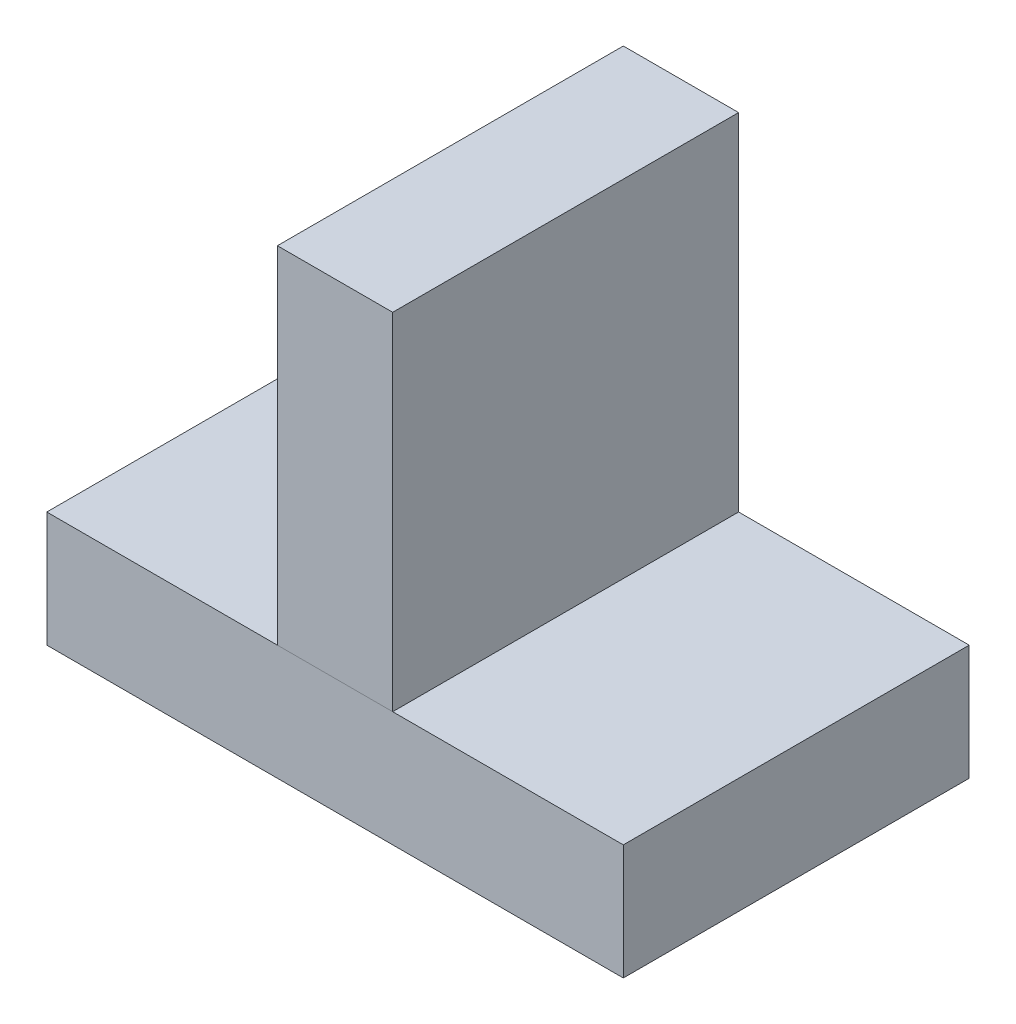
from build123d import *

# Parameters (mm, degrees)
SKETCH_1_W      = 50
SKETCH_1_H      = 30
EXTRUDE_1_DEPTH = 10
SKETCH_4_W      = 10
SKETCH_4_H      = 30
EXTRUDE_2_DEPTH = 15


with BuildPart() as part:
    # Sketch 1 → Extrude 1 (new body)
    with BuildSketch(Plane(origin=(0, 0, 0), x_dir=(1, 0, 0), z_dir=(0, 1, 0))):
        Rectangle(SKETCH_1_W, SKETCH_1_H)
    extrude(amount=EXTRUDE_1_DEPTH)


with BuildPart() as body_2:
    # Sketch 4 → Extrude 2 (new, symmetric)
    with BuildSketch(Plane.XY):
        with Locations((0, 25)):
            Rectangle(SKETCH_4_W, SKETCH_4_H)
    extrude(amount=EXTRUDE_2_DEPTH, both=True)


solid = Compound([part.part, body_2.part])
